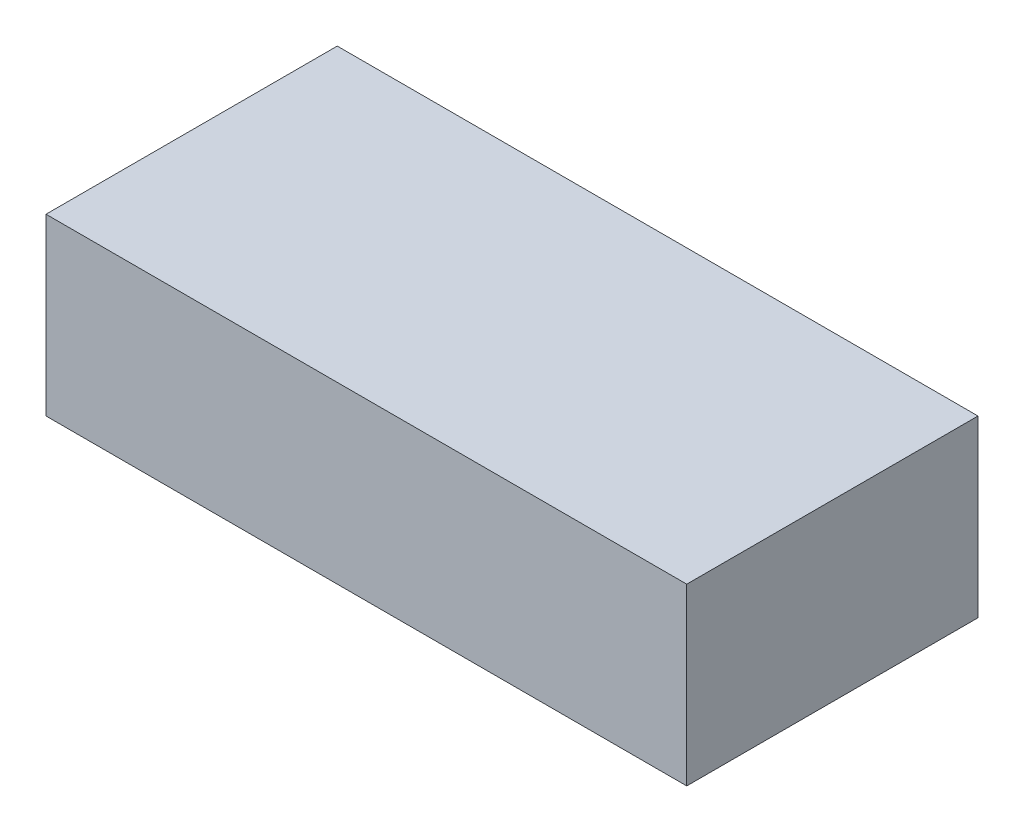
ISO-10303-21;
HEADER;
FILE_DESCRIPTION(('STEP AP214'),'2;1');
FILE_NAME('part.step','',(''),(''),'','','');
FILE_SCHEMA(('AUTOMOTIVE_DESIGN { 1 0 10303 214 1 1 1 1 }'));
ENDSEC;
DATA;
#1=APPLICATION_CONTEXT('core data for automotive mechanical design processes');
#2=APPLICATION_PROTOCOL_DEFINITION('international standard','automotive_design',2000,#1);
#3=PRODUCT_CONTEXT('',#1,'mechanical');
#4=PRODUCT('Part','Part','',(#3));
#5=PRODUCT_RELATED_PRODUCT_CATEGORY('part','',(#4));
#6=PRODUCT_DEFINITION_FORMATION('','',#4);
#7=PRODUCT_DEFINITION_CONTEXT('part definition',#1,'design');
#8=PRODUCT_DEFINITION('design','',#6,#7);
#9=PRODUCT_DEFINITION_SHAPE('','',#8);
#10=(LENGTH_UNIT() NAMED_UNIT(*) SI_UNIT(.MILLI.,.METRE.));
#11=(NAMED_UNIT(*) PLANE_ANGLE_UNIT() SI_UNIT($,.RADIAN.));
#12=(NAMED_UNIT(*) SI_UNIT($,.STERADIAN.) SOLID_ANGLE_UNIT());
#13=UNCERTAINTY_MEASURE_WITH_UNIT(LENGTH_MEASURE(1.E-05),#10,'distance_accuracy_value','');
#14=(GEOMETRIC_REPRESENTATION_CONTEXT(3) GLOBAL_UNCERTAINTY_ASSIGNED_CONTEXT((#13)) GLOBAL_UNIT_ASSIGNED_CONTEXT((#10,
#11,#12)) REPRESENTATION_CONTEXT('',''));
#15=CARTESIAN_POINT('',(0.,0.,0.));
#16=DIRECTION('',(0.,0.,1.));
#17=DIRECTION('',(1.,0.,0.));
#18=AXIS2_PLACEMENT_3D('',#15,#16,#17);
#19=CARTESIAN_POINT('',(0.,38.1,0.));
#20=DIRECTION('',(-1.,0.,0.));
#21=DIRECTION('',(0.,0.,1.));
#22=AXIS2_PLACEMENT_3D('',#19,#20,#21);
#23=PLANE('',#22);
#24=DIRECTION('',(0.,0.,-1.));
#25=VECTOR('',#24,1.);
#26=CARTESIAN_POINT('',(0.,0.,0.));
#27=LINE('',#26,#25);
#28=CARTESIAN_POINT('',(0.,0.,0.));
#29=VERTEX_POINT('',#28);
#30=CARTESIAN_POINT('',(0.,0.,-63.5));
#31=VERTEX_POINT('',#30);
#32=EDGE_CURVE('E94',#29,#31,#27,.T.);
#33=ORIENTED_EDGE('',*,*,#32,.T.);
#34=DIRECTION('',(0.,-1.,0.));
#35=VECTOR('',#34,1.);
#36=CARTESIAN_POINT('',(0.,38.1,-63.5));
#37=LINE('',#36,#35);
#38=CARTESIAN_POINT('',(0.,38.1,-63.5));
#39=VERTEX_POINT('',#38);
#40=EDGE_CURVE('E11',#39,#31,#37,.T.);
#41=ORIENTED_EDGE('',*,*,#40,.F.);
#42=DIRECTION('',(0.,0.,-1.));
#43=VECTOR('',#42,1.);
#44=CARTESIAN_POINT('',(0.,38.1,0.));
#45=LINE('',#44,#43);
#46=CARTESIAN_POINT('',(0.,38.1,0.));
#47=VERTEX_POINT('',#46);
#48=EDGE_CURVE('E82',#47,#39,#45,.T.);
#49=ORIENTED_EDGE('',*,*,#48,.F.);
#50=DIRECTION('',(0.,-1.,0.));
#51=VECTOR('',#50,1.);
#52=CARTESIAN_POINT('',(0.,38.1,0.));
#53=LINE('',#52,#51);
#54=EDGE_CURVE('E90',#47,#29,#53,.T.);
#55=ORIENTED_EDGE('',*,*,#54,.T.);
#56=EDGE_LOOP('',(#33,#41,#49,#55));
#57=FACE_BOUND('',#56,.T.);
#58=ADVANCED_FACE('F31',(#57),#23,.F.);
#59=CARTESIAN_POINT('',(0.,38.1,-63.5));
#60=DIRECTION('',(0.,0.,1.));
#61=DIRECTION('',(1.,0.,0.));
#62=AXIS2_PLACEMENT_3D('',#59,#60,#61);
#63=PLANE('',#62);
#64=DIRECTION('',(-1.,0.,0.));
#65=VECTOR('',#64,1.);
#66=CARTESIAN_POINT('',(0.,0.,-63.5));
#67=LINE('',#66,#65);
#68=CARTESIAN_POINT('',(-139.7,0.,-63.5));
#69=VERTEX_POINT('',#68);
#70=EDGE_CURVE('E86',#31,#69,#67,.T.);
#71=ORIENTED_EDGE('',*,*,#70,.T.);
#72=DIRECTION('',(0.,-1.,0.));
#73=VECTOR('',#72,1.);
#74=CARTESIAN_POINT('',(-139.7,38.1,-63.5));
#75=LINE('',#74,#73);
#76=CARTESIAN_POINT('',(-139.7,38.1,-63.5));
#77=VERTEX_POINT('',#76);
#78=EDGE_CURVE('E39',#77,#69,#75,.T.);
#79=ORIENTED_EDGE('',*,*,#78,.F.);
#80=DIRECTION('',(-1.,0.,0.));
#81=VECTOR('',#80,1.);
#82=CARTESIAN_POINT('',(0.,38.1,-63.5));
#83=LINE('',#82,#81);
#84=EDGE_CURVE('E77',#39,#77,#83,.T.);
#85=ORIENTED_EDGE('',*,*,#84,.F.);
#86=ORIENTED_EDGE('',*,*,#40,.T.);
#87=EDGE_LOOP('',(#71,#79,#85,#86));
#88=FACE_BOUND('',#87,.T.);
#89=ADVANCED_FACE('F85',(#88),#63,.F.);
#90=CARTESIAN_POINT('',(-139.7,38.1,0.));
#91=DIRECTION('',(1.,0.,0.));
#92=DIRECTION('',(0.,0.,-1.));
#93=AXIS2_PLACEMENT_3D('',#90,#91,#92);
#94=PLANE('',#93);
#95=DIRECTION('',(0.,0.,1.));
#96=VECTOR('',#95,1.);
#97=CARTESIAN_POINT('',(-139.7,0.,0.));
#98=LINE('',#97,#96);
#99=CARTESIAN_POINT('',(-139.7,0.,0.));
#100=VERTEX_POINT('',#99);
#101=EDGE_CURVE('E64',#69,#100,#98,.T.);
#102=ORIENTED_EDGE('',*,*,#101,.T.);
#103=DIRECTION('',(0.,-1.,0.));
#104=VECTOR('',#103,1.);
#105=CARTESIAN_POINT('',(-139.7,38.1,0.));
#106=LINE('',#105,#104);
#107=CARTESIAN_POINT('',(-139.7,38.1,0.));
#108=VERTEX_POINT('',#107);
#109=EDGE_CURVE('E87',#108,#100,#106,.T.);
#110=ORIENTED_EDGE('',*,*,#109,.F.);
#111=DIRECTION('',(0.,0.,1.));
#112=VECTOR('',#111,1.);
#113=CARTESIAN_POINT('',(-139.7,38.1,0.));
#114=LINE('',#113,#112);
#115=EDGE_CURVE('E80',#77,#108,#114,.T.);
#116=ORIENTED_EDGE('',*,*,#115,.F.);
#117=ORIENTED_EDGE('',*,*,#78,.T.);
#118=EDGE_LOOP('',(#102,#110,#116,#117));
#119=FACE_BOUND('',#118,.T.);
#120=ADVANCED_FACE('F88',(#119),#94,.F.);
#121=CARTESIAN_POINT('',(0.,38.1,0.));
#122=DIRECTION('',(0.,0.,-1.));
#123=DIRECTION('',(-1.,0.,0.));
#124=AXIS2_PLACEMENT_3D('',#121,#122,#123);
#125=PLANE('',#124);
#126=DIRECTION('',(1.,0.,0.));
#127=VECTOR('',#126,1.);
#128=CARTESIAN_POINT('',(0.,0.,0.));
#129=LINE('',#128,#127);
#130=EDGE_CURVE('E70',#100,#29,#129,.T.);
#131=ORIENTED_EDGE('',*,*,#130,.T.);
#132=ORIENTED_EDGE('',*,*,#54,.F.);
#133=DIRECTION('',(1.,0.,0.));
#134=VECTOR('',#133,1.);
#135=CARTESIAN_POINT('',(0.,38.1,0.));
#136=LINE('',#135,#134);
#137=EDGE_CURVE('E47',#108,#47,#136,.T.);
#138=ORIENTED_EDGE('',*,*,#137,.F.);
#139=ORIENTED_EDGE('',*,*,#109,.T.);
#140=EDGE_LOOP('',(#131,#132,#138,#139));
#141=FACE_BOUND('',#140,.T.);
#142=ADVANCED_FACE('F101',(#141),#125,.F.);
#143=CARTESIAN_POINT('',(0.,38.1,-63.5));
#144=DIRECTION('',(0.,1.,0.));
#145=DIRECTION('',(0.,0.,1.));
#146=AXIS2_PLACEMENT_3D('',#143,#144,#145);
#147=PLANE('',#146);
#148=ORIENTED_EDGE('',*,*,#48,.T.);
#149=ORIENTED_EDGE('',*,*,#84,.T.);
#150=ORIENTED_EDGE('',*,*,#115,.T.);
#151=ORIENTED_EDGE('',*,*,#137,.T.);
#152=EDGE_LOOP('',(#148,#149,#150,#151));
#153=FACE_BOUND('',#152,.T.);
#154=ADVANCED_FACE('F78',(#153),#147,.T.);
#155=CARTESIAN_POINT('',(0.,0.,-63.5));
#156=DIRECTION('',(0.,1.,0.));
#157=DIRECTION('',(0.,0.,1.));
#158=AXIS2_PLACEMENT_3D('',#155,#156,#157);
#159=PLANE('',#158);
#160=ORIENTED_EDGE('',*,*,#32,.F.);
#161=ORIENTED_EDGE('',*,*,#130,.F.);
#162=ORIENTED_EDGE('',*,*,#101,.F.);
#163=ORIENTED_EDGE('',*,*,#70,.F.);
#164=EDGE_LOOP('',(#160,#161,#162,#163));
#165=FACE_BOUND('',#164,.T.);
#166=ADVANCED_FACE('F104',(#165),#159,.F.);
#167=CLOSED_SHELL('',(#58,#89,#120,#142,#154,#166));
#168=MANIFOLD_SOLID_BREP('B2',#167);
#169=ADVANCED_BREP_SHAPE_REPRESENTATION('',(#18,#168),#14);
#170=SHAPE_DEFINITION_REPRESENTATION(#9,#169);
ENDSEC;
END-ISO-10303-21;
